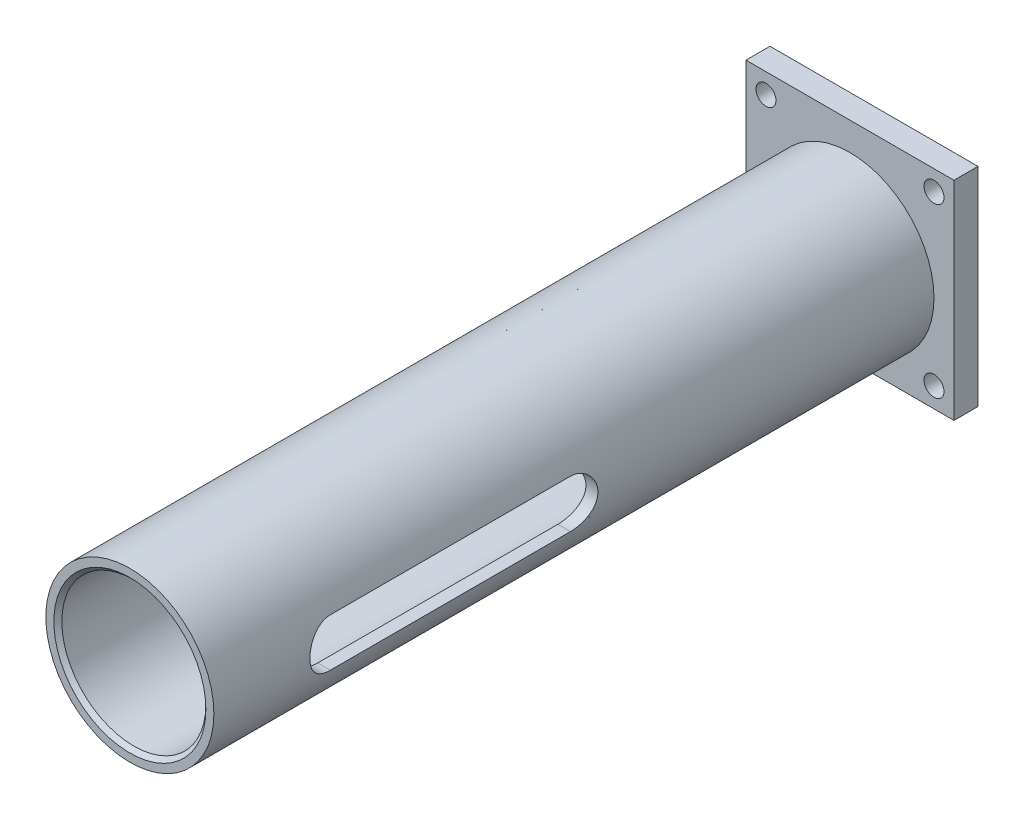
ISO-10303-21;
HEADER;
FILE_DESCRIPTION(('STEP AP214'),'2;1');
FILE_NAME('part.step','',(''),(''),'','','');
FILE_SCHEMA(('AUTOMOTIVE_DESIGN { 1 0 10303 214 1 1 1 1 }'));
ENDSEC;
DATA;
#1=APPLICATION_CONTEXT('core data for automotive mechanical design processes');
#2=APPLICATION_PROTOCOL_DEFINITION('international standard','automotive_design',2000,#1);
#3=PRODUCT_CONTEXT('',#1,'mechanical');
#4=PRODUCT('Part','Part','',(#3));
#5=PRODUCT_RELATED_PRODUCT_CATEGORY('part','',(#4));
#6=PRODUCT_DEFINITION_FORMATION('','',#4);
#7=PRODUCT_DEFINITION_CONTEXT('part definition',#1,'design');
#8=PRODUCT_DEFINITION('design','',#6,#7);
#9=PRODUCT_DEFINITION_SHAPE('','',#8);
#10=(LENGTH_UNIT() NAMED_UNIT(*) SI_UNIT(.MILLI.,.METRE.));
#11=(NAMED_UNIT(*) PLANE_ANGLE_UNIT() SI_UNIT($,.RADIAN.));
#12=(NAMED_UNIT(*) SI_UNIT($,.STERADIAN.) SOLID_ANGLE_UNIT());
#13=UNCERTAINTY_MEASURE_WITH_UNIT(LENGTH_MEASURE(1.E-05),#10,'distance_accuracy_value','');
#14=(GEOMETRIC_REPRESENTATION_CONTEXT(3) GLOBAL_UNCERTAINTY_ASSIGNED_CONTEXT((#13)) GLOBAL_UNIT_ASSIGNED_CONTEXT((#10,
#11,#12)) REPRESENTATION_CONTEXT('',''));
#15=CARTESIAN_POINT('',(0.,0.,0.));
#16=DIRECTION('',(0.,0.,1.));
#17=DIRECTION('',(1.,0.,0.));
#18=AXIS2_PLACEMENT_3D('',#15,#16,#17);
#19=CARTESIAN_POINT('',(0.,0.,3.));
#20=DIRECTION('',(0.,0.,1.));
#21=DIRECTION('',(1.,0.,0.));
#22=AXIS2_PLACEMENT_3D('',#19,#20,#21);
#23=PLANE('',#22);
#24=DIRECTION('',(0.,1.,0.));
#25=VECTOR('',#24,1.);
#26=CARTESIAN_POINT('',(13.,13.,3.));
#27=LINE('',#26,#25);
#28=CARTESIAN_POINT('',(13.,-13.,3.));
#29=VERTEX_POINT('',#28);
#30=CARTESIAN_POINT('',(13.,13.,3.));
#31=VERTEX_POINT('',#30);
#32=EDGE_CURVE('E297',#29,#31,#27,.T.);
#33=ORIENTED_EDGE('',*,*,#32,.T.);
#34=DIRECTION('',(-1.,0.,0.));
#35=VECTOR('',#34,1.);
#36=CARTESIAN_POINT('',(-13.,13.,3.));
#37=LINE('',#36,#35);
#38=CARTESIAN_POINT('',(-13.,13.,3.));
#39=VERTEX_POINT('',#38);
#40=EDGE_CURVE('E309',#31,#39,#37,.T.);
#41=ORIENTED_EDGE('',*,*,#40,.T.);
#42=DIRECTION('',(0.,-1.,0.));
#43=VECTOR('',#42,1.);
#44=CARTESIAN_POINT('',(-13.,13.,3.));
#45=LINE('',#44,#43);
#46=CARTESIAN_POINT('',(-13.,-13.,3.));
#47=VERTEX_POINT('',#46);
#48=EDGE_CURVE('E307',#39,#47,#45,.T.);
#49=ORIENTED_EDGE('',*,*,#48,.T.);
#50=DIRECTION('',(1.,0.,0.));
#51=VECTOR('',#50,1.);
#52=CARTESIAN_POINT('',(-13.,-13.,3.));
#53=LINE('',#52,#51);
#54=EDGE_CURVE('E294',#47,#29,#53,.T.);
#55=ORIENTED_EDGE('',*,*,#54,.T.);
#56=EDGE_LOOP('',(#33,#41,#49,#55));
#57=FACE_BOUND('',#56,.T.);
#58=CARTESIAN_POINT('',(0.,-0.999999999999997,3.));
#59=DIRECTION('',(0.,0.,1.));
#60=DIRECTION('',(1.,0.,0.));
#61=AXIS2_PLACEMENT_3D('',#58,#59,#60);
#62=CIRCLE('',#61,10.5);
#63=CARTESIAN_POINT('',(10.5,-0.999999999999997,3.));
#64=VERTEX_POINT('',#63);
#65=EDGE_CURVE('E316',#64,#64,#62,.T.);
#66=ORIENTED_EDGE('',*,*,#65,.F.);
#67=EDGE_LOOP('',(#66));
#68=FACE_BOUND('',#67,.T.);
#69=CARTESIAN_POINT('',(-10.5,-10.5,3.));
#70=DIRECTION('',(0.,0.,1.));
#71=DIRECTION('',(1.,0.,0.));
#72=AXIS2_PLACEMENT_3D('',#69,#70,#71);
#73=CIRCLE('',#72,1.25);
#74=CARTESIAN_POINT('',(-9.25,-10.5,3.));
#75=VERTEX_POINT('',#74);
#76=EDGE_CURVE('E333',#75,#75,#73,.T.);
#77=ORIENTED_EDGE('',*,*,#76,.F.);
#78=EDGE_LOOP('',(#77));
#79=FACE_BOUND('',#78,.T.);
#80=CARTESIAN_POINT('',(10.5,10.5,3.));
#81=DIRECTION('',(0.,0.,1.));
#82=DIRECTION('',(1.,0.,0.));
#83=AXIS2_PLACEMENT_3D('',#80,#81,#82);
#84=CIRCLE('',#83,1.25);
#85=CARTESIAN_POINT('',(11.75,10.5,3.));
#86=VERTEX_POINT('',#85);
#87=EDGE_CURVE('E337',#86,#86,#84,.T.);
#88=ORIENTED_EDGE('',*,*,#87,.F.);
#89=EDGE_LOOP('',(#88));
#90=FACE_BOUND('',#89,.T.);
#91=CARTESIAN_POINT('',(-10.5,10.5,3.));
#92=DIRECTION('',(0.,0.,1.));
#93=DIRECTION('',(1.,0.,0.));
#94=AXIS2_PLACEMENT_3D('',#91,#92,#93);
#95=CIRCLE('',#94,1.25);
#96=CARTESIAN_POINT('',(-9.25,10.5,3.));
#97=VERTEX_POINT('',#96);
#98=EDGE_CURVE('E341',#97,#97,#95,.T.);
#99=ORIENTED_EDGE('',*,*,#98,.F.);
#100=EDGE_LOOP('',(#99));
#101=FACE_BOUND('',#100,.T.);
#102=CARTESIAN_POINT('',(10.5,-10.5,3.));
#103=DIRECTION('',(0.,0.,1.));
#104=DIRECTION('',(1.,0.,0.));
#105=AXIS2_PLACEMENT_3D('',#102,#103,#104);
#106=CIRCLE('',#105,1.25);
#107=CARTESIAN_POINT('',(11.75,-10.5,3.));
#108=VERTEX_POINT('',#107);
#109=EDGE_CURVE('E344',#108,#108,#106,.T.);
#110=ORIENTED_EDGE('',*,*,#109,.F.);
#111=EDGE_LOOP('',(#110));
#112=FACE_BOUND('',#111,.T.);
#113=ADVANCED_FACE('F34',(#57,#68,#79,#90,#101,#112),#23,.T.);
#114=CARTESIAN_POINT('',(0.,0.,0.));
#115=DIRECTION('',(0.,0.,1.));
#116=DIRECTION('',(1.,0.,0.));
#117=AXIS2_PLACEMENT_3D('',#114,#115,#116);
#118=PLANE('',#117);
#119=DIRECTION('',(0.,1.,0.));
#120=VECTOR('',#119,1.);
#121=CARTESIAN_POINT('',(13.,13.,0.));
#122=LINE('',#121,#120);
#123=CARTESIAN_POINT('',(13.,-13.,0.));
#124=VERTEX_POINT('',#123);
#125=CARTESIAN_POINT('',(13.,13.,0.));
#126=VERTEX_POINT('',#125);
#127=EDGE_CURVE('E302',#124,#126,#122,.T.);
#128=ORIENTED_EDGE('',*,*,#127,.F.);
#129=DIRECTION('',(1.,0.,0.));
#130=VECTOR('',#129,1.);
#131=CARTESIAN_POINT('',(-13.,-13.,0.));
#132=LINE('',#131,#130);
#133=CARTESIAN_POINT('',(-13.,-13.,0.));
#134=VERTEX_POINT('',#133);
#135=EDGE_CURVE('E295',#134,#124,#132,.T.);
#136=ORIENTED_EDGE('',*,*,#135,.F.);
#137=DIRECTION('',(0.,-1.,0.));
#138=VECTOR('',#137,1.);
#139=CARTESIAN_POINT('',(-13.,13.,0.));
#140=LINE('',#139,#138);
#141=CARTESIAN_POINT('',(-13.,13.,0.));
#142=VERTEX_POINT('',#141);
#143=EDGE_CURVE('E298',#142,#134,#140,.T.);
#144=ORIENTED_EDGE('',*,*,#143,.F.);
#145=DIRECTION('',(-1.,0.,0.));
#146=VECTOR('',#145,1.);
#147=CARTESIAN_POINT('',(-13.,13.,0.));
#148=LINE('',#147,#146);
#149=EDGE_CURVE('E300',#126,#142,#148,.T.);
#150=ORIENTED_EDGE('',*,*,#149,.F.);
#151=EDGE_LOOP('',(#128,#136,#144,#150));
#152=FACE_BOUND('',#151,.T.);
#153=CARTESIAN_POINT('',(0.,-0.999999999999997,0.));
#154=DIRECTION('',(0.,0.,1.));
#155=DIRECTION('',(1.,0.,0.));
#156=AXIS2_PLACEMENT_3D('',#153,#154,#155);
#157=CIRCLE('',#156,11.15);
#158=CARTESIAN_POINT('',(11.15,-0.999999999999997,0.));
#159=VERTEX_POINT('',#158);
#160=EDGE_CURVE('E279',#159,#159,#157,.F.);
#161=ORIENTED_EDGE('',*,*,#160,.F.);
#162=EDGE_LOOP('',(#161));
#163=FACE_BOUND('',#162,.T.);
#164=CARTESIAN_POINT('',(-10.5,-10.5,0.));
#165=DIRECTION('',(0.,0.,1.));
#166=DIRECTION('',(1.,0.,0.));
#167=AXIS2_PLACEMENT_3D('',#164,#165,#166);
#168=CIRCLE('',#167,1.25);
#169=CARTESIAN_POINT('',(-9.25,-10.5,0.));
#170=VERTEX_POINT('',#169);
#171=EDGE_CURVE('E250',#170,#170,#168,.F.);
#172=ORIENTED_EDGE('',*,*,#171,.F.);
#173=EDGE_LOOP('',(#172));
#174=FACE_BOUND('',#173,.T.);
#175=CARTESIAN_POINT('',(10.5,10.5,0.));
#176=DIRECTION('',(0.,0.,1.));
#177=DIRECTION('',(1.,0.,0.));
#178=AXIS2_PLACEMENT_3D('',#175,#176,#177);
#179=CIRCLE('',#178,1.25);
#180=CARTESIAN_POINT('',(11.75,10.5,0.));
#181=VERTEX_POINT('',#180);
#182=EDGE_CURVE('E356',#181,#181,#179,.F.);
#183=ORIENTED_EDGE('',*,*,#182,.F.);
#184=EDGE_LOOP('',(#183));
#185=FACE_BOUND('',#184,.T.);
#186=CARTESIAN_POINT('',(-10.5,10.5,0.));
#187=DIRECTION('',(0.,0.,1.));
#188=DIRECTION('',(1.,0.,0.));
#189=AXIS2_PLACEMENT_3D('',#186,#187,#188);
#190=CIRCLE('',#189,1.25);
#191=CARTESIAN_POINT('',(-9.25,10.5,0.));
#192=VERTEX_POINT('',#191);
#193=EDGE_CURVE('E352',#192,#192,#190,.F.);
#194=ORIENTED_EDGE('',*,*,#193,.F.);
#195=EDGE_LOOP('',(#194));
#196=FACE_BOUND('',#195,.T.);
#197=CARTESIAN_POINT('',(10.5,-10.5,0.));
#198=DIRECTION('',(0.,0.,1.));
#199=DIRECTION('',(1.,0.,0.));
#200=AXIS2_PLACEMENT_3D('',#197,#198,#199);
#201=CIRCLE('',#200,1.25);
#202=CARTESIAN_POINT('',(11.75,-10.5,0.));
#203=VERTEX_POINT('',#202);
#204=EDGE_CURVE('E346',#203,#203,#201,.F.);
#205=ORIENTED_EDGE('',*,*,#204,.F.);
#206=EDGE_LOOP('',(#205));
#207=FACE_BOUND('',#206,.T.);
#208=ADVANCED_FACE('F328',(#152,#163,#174,#185,#196,#207),#118,.F.);
#209=CARTESIAN_POINT('',(13.,13.,3.));
#210=DIRECTION('',(-1.,0.,0.));
#211=DIRECTION('',(0.,-1.,0.));
#212=AXIS2_PLACEMENT_3D('',#209,#210,#211);
#213=PLANE('',#212);
#214=ORIENTED_EDGE('',*,*,#127,.T.);
#215=DIRECTION('',(0.,0.,-1.));
#216=VECTOR('',#215,1.);
#217=CARTESIAN_POINT('',(13.,13.,3.));
#218=LINE('',#217,#216);
#219=EDGE_CURVE('E282',#31,#126,#218,.T.);
#220=ORIENTED_EDGE('',*,*,#219,.F.);
#221=ORIENTED_EDGE('',*,*,#32,.F.);
#222=DIRECTION('',(0.,0.,-1.));
#223=VECTOR('',#222,1.);
#224=CARTESIAN_POINT('',(13.,-13.,3.));
#225=LINE('',#224,#223);
#226=EDGE_CURVE('E291',#29,#124,#225,.T.);
#227=ORIENTED_EDGE('',*,*,#226,.T.);
#228=EDGE_LOOP('',(#214,#220,#221,#227));
#229=FACE_BOUND('',#228,.T.);
#230=ADVANCED_FACE('F367',(#229),#213,.F.);
#231=CARTESIAN_POINT('',(-13.,13.,3.));
#232=DIRECTION('',(0.,-1.,0.));
#233=DIRECTION('',(0.,0.,-1.));
#234=AXIS2_PLACEMENT_3D('',#231,#232,#233);
#235=PLANE('',#234);
#236=ORIENTED_EDGE('',*,*,#149,.T.);
#237=DIRECTION('',(0.,0.,-1.));
#238=VECTOR('',#237,1.);
#239=CARTESIAN_POINT('',(-13.,13.,3.));
#240=LINE('',#239,#238);
#241=EDGE_CURVE('E285',#39,#142,#240,.T.);
#242=ORIENTED_EDGE('',*,*,#241,.F.);
#243=ORIENTED_EDGE('',*,*,#40,.F.);
#244=ORIENTED_EDGE('',*,*,#219,.T.);
#245=EDGE_LOOP('',(#236,#242,#243,#244));
#246=FACE_BOUND('',#245,.T.);
#247=ADVANCED_FACE('F425',(#246),#235,.F.);
#248=CARTESIAN_POINT('',(-13.,13.,3.));
#249=DIRECTION('',(1.,0.,0.));
#250=DIRECTION('',(0.,1.,0.));
#251=AXIS2_PLACEMENT_3D('',#248,#249,#250);
#252=PLANE('',#251);
#253=ORIENTED_EDGE('',*,*,#143,.T.);
#254=DIRECTION('',(0.,0.,-1.));
#255=VECTOR('',#254,1.);
#256=CARTESIAN_POINT('',(-13.,-13.,3.));
#257=LINE('',#256,#255);
#258=EDGE_CURVE('E288',#47,#134,#257,.T.);
#259=ORIENTED_EDGE('',*,*,#258,.F.);
#260=ORIENTED_EDGE('',*,*,#48,.F.);
#261=ORIENTED_EDGE('',*,*,#241,.T.);
#262=EDGE_LOOP('',(#253,#259,#260,#261));
#263=FACE_BOUND('',#262,.T.);
#264=ADVANCED_FACE('F429',(#263),#252,.F.);
#265=CARTESIAN_POINT('',(-13.,-13.,3.));
#266=DIRECTION('',(0.,1.,0.));
#267=DIRECTION('',(0.,0.,1.));
#268=AXIS2_PLACEMENT_3D('',#265,#266,#267);
#269=PLANE('',#268);
#270=ORIENTED_EDGE('',*,*,#135,.T.);
#271=ORIENTED_EDGE('',*,*,#226,.F.);
#272=ORIENTED_EDGE('',*,*,#54,.F.);
#273=ORIENTED_EDGE('',*,*,#258,.T.);
#274=EDGE_LOOP('',(#270,#271,#272,#273));
#275=FACE_BOUND('',#274,.T.);
#276=ADVANCED_FACE('F194',(#275),#269,.F.);
#277=CARTESIAN_POINT('',(0.,-0.999999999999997,3.));
#278=DIRECTION('',(0.,0.,-1.));
#279=DIRECTION('',(-1.,0.,0.));
#280=AXIS2_PLACEMENT_3D('',#277,#278,#279);
#281=CYLINDRICAL_SURFACE('',#280,9.);
#282=CARTESIAN_POINT('',(0.,-0.999999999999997,92.5));
#283=DIRECTION('',(0.,0.,1.));
#284=DIRECTION('',(1.,0.,0.));
#285=AXIS2_PLACEMENT_3D('',#282,#283,#284);
#286=CIRCLE('',#285,9.);
#287=CARTESIAN_POINT('',(9.00000000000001,-0.999999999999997,92.5));
#288=VERTEX_POINT('',#287);
#289=EDGE_CURVE('E42',#288,#288,#286,.T.);
#290=ORIENTED_EDGE('',*,*,#289,.T.);
#291=EDGE_LOOP('',(#290));
#292=FACE_BOUND('',#291,.T.);
#293=CARTESIAN_POINT('',(-8.48528137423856,2.,78.));
#294=CARTESIAN_POINT('',(-8.48526831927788,2.00001078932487,78.0818484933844));
#295=CARTESIAN_POINT('',(-8.48646532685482,1.99665064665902,78.1636896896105));
#296=CARTESIAN_POINT('',(-8.49118228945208,1.98327254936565,78.3267372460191));
#297=CARTESIAN_POINT('',(-8.4947016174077,1.97325639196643,78.4079437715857));
#298=CARTESIAN_POINT('',(-8.50395246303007,1.94668951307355,78.5689085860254));
#299=CARTESIAN_POINT('',(-8.50967741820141,1.93015817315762,78.648670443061));
#300=CARTESIAN_POINT('',(-8.52315143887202,1.89073017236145,78.8064099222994));
#301=CARTESIAN_POINT('',(-8.53090057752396,1.86783328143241,78.884387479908));
#302=CARTESIAN_POINT('',(-8.55683928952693,1.78989861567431,79.1147538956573));
#303=CARTESIAN_POINT('',(-8.57773492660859,1.72557700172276,79.2638149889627));
#304=CARTESIAN_POINT('',(-8.62436440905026,1.5742134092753,79.5490521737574));
#305=CARTESIAN_POINT('',(-8.65010122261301,1.4871574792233,79.6852202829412));
#306=CARTESIAN_POINT('',(-8.70463418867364,1.28915595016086,79.9461514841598));
#307=CARTESIAN_POINT('',(-8.73350627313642,1.17747541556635,80.0703421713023));
#308=CARTESIAN_POINT('',(-8.79041552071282,0.934964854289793,80.2986205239));
#309=CARTESIAN_POINT('',(-8.81845253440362,0.804131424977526,80.402704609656));
#310=CARTESIAN_POINT('',(-8.87141647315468,0.52281106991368,80.5904378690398));
#311=CARTESIAN_POINT('',(-8.8962431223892,0.371900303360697,80.6734827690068));
#312=CARTESIAN_POINT('',(-8.93908826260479,0.0572877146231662,80.8127769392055));
#313=CARTESIAN_POINT('',(-8.95710883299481,-0.106410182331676,80.8690343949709));
#314=CARTESIAN_POINT('',(-8.98377213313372,-0.43591195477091,80.9512071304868));
#315=CARTESIAN_POINT('',(-8.9927192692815,-0.601444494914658,80.9781098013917));
#316=CARTESIAN_POINT('',(-9.00130825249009,-0.934903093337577,81.0039489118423));
#317=CARTESIAN_POINT('',(-9.00095231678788,-1.10282857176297,81.0028920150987));
#318=CARTESIAN_POINT('',(-8.99118115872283,-1.42931153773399,80.9734671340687));
#319=CARTESIAN_POINT('',(-8.98212182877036,-1.58797811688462,80.9461720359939));
#320=CARTESIAN_POINT('',(-8.95640881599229,-1.89833218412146,80.8668204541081));
#321=CARTESIAN_POINT('',(-8.93975471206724,-2.05001928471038,80.8147625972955));
#322=CARTESIAN_POINT('',(-8.9002700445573,-2.34445790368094,80.6867357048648));
#323=CARTESIAN_POINT('',(-8.87736112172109,-2.48706564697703,80.6104611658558));
#324=CARTESIAN_POINT('',(-8.82775164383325,-2.757773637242,80.4364208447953));
#325=CARTESIAN_POINT('',(-8.80105005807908,-2.88586992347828,80.3386492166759));
#326=CARTESIAN_POINT('',(-8.74518810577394,-3.13029252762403,80.1189841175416));
#327=CARTESIAN_POINT('',(-8.71597116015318,-3.24578277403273,79.9961729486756));
#328=CARTESIAN_POINT('',(-8.65942491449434,-3.45481413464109,79.7326859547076));
#329=CARTESIAN_POINT('',(-8.63209622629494,-3.5483481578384,79.5920043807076));
#330=CARTESIAN_POINT('',(-8.58210018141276,-3.71201733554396,79.2939199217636));
#331=CARTESIAN_POINT('',(-8.55950759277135,-3.78178668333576,79.1363008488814));
#332=CARTESIAN_POINT('',(-8.53168491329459,-3.86551808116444,78.8923158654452));
#333=CARTESIAN_POINT('',(-8.52342263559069,-3.889939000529,78.8097432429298));
#334=CARTESIAN_POINT('',(-8.50917513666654,-3.93162549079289,78.6426296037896));
#335=CARTESIAN_POINT('',(-8.50318887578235,-3.94889432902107,78.5580895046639));
#336=CARTESIAN_POINT('',(-8.49410161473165,-3.97496555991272,78.3947667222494));
#337=CARTESIAN_POINT('',(-8.49080270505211,-3.98435073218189,78.3160871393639));
#338=CARTESIAN_POINT('',(-8.48638843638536,-3.99686829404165,78.1582744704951));
#339=CARTESIAN_POINT('',(-8.48527025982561,-4.00000875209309,78.0791421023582));
#340=CARTESIAN_POINT('',(-8.48528137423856,-4.,78.));
#341=B_SPLINE_CURVE_WITH_KNOTS('',3,(#293,#294,#295,#296,#297,#298,#299,#300,#301,#302,#303,
#304,#305,#306,#307,#308,#309,#310,#311,#312,#313,#314,#315,#316,#317,#318,#319,#320,#321,#322,
#323,#324,#325,#326,#327,#328,#329,#330,#331,#332,#333,#334,#335,#336,#337,#338,#339,#340),
.UNSPECIFIED.,.F.,.F.,(4,2,2,2,2,2,2,2,2,2,2,2,2,2,2,2,2,2,2,2,2,2,2,4),(0.,0.245455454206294,
0.490844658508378,0.735509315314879,0.980182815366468,1.46881220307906,1.95774215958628,
2.46393436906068,2.97021661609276,3.48971320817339,4.00905095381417,4.51032334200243,
5.01147626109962,5.4929717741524,5.97449398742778,6.46234978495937,6.9503384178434,
7.46126084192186,7.97234804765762,8.49098011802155,8.75020549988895,9.0093123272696,
9.24695816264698,9.48429674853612),.UNSPECIFIED.);
#342=CARTESIAN_POINT('',(-8.48528137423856,2.,78.));
#343=VERTEX_POINT('',#342);
#344=CARTESIAN_POINT('',(-8.48528137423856,-4.,78.));
#345=VERTEX_POINT('',#344);
#346=EDGE_CURVE('E138',#343,#345,#341,.T.);
#347=ORIENTED_EDGE('',*,*,#346,.F.);
#348=DIRECTION('',(0.,0.,-1.));
#349=VECTOR('',#348,1.);
#350=CARTESIAN_POINT('',(-8.48528137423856,2.,3.));
#351=LINE('',#350,#349);
#352=CARTESIAN_POINT('',(-8.48528137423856,2.,48.));
#353=VERTEX_POINT('',#352);
#354=EDGE_CURVE('E212',#353,#343,#351,.F.);
#355=ORIENTED_EDGE('',*,*,#354,.F.);
#356=CARTESIAN_POINT('',(-8.48528137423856,-4.,48.));
#357=CARTESIAN_POINT('',(-8.48526831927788,-4.00001078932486,47.9181515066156));
#358=CARTESIAN_POINT('',(-8.48646532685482,-3.99665064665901,47.8363103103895));
#359=CARTESIAN_POINT('',(-8.49118228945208,-3.98327254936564,47.6732627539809));
#360=CARTESIAN_POINT('',(-8.4947016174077,-3.97325639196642,47.5920562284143));
#361=CARTESIAN_POINT('',(-8.50395246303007,-3.94668951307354,47.4310914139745));
#362=CARTESIAN_POINT('',(-8.50967741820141,-3.93015817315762,47.351329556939));
#363=CARTESIAN_POINT('',(-8.52315143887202,-3.89073017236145,47.1935900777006));
#364=CARTESIAN_POINT('',(-8.53090057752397,-3.8678332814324,47.115612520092));
#365=CARTESIAN_POINT('',(-8.55683928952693,-3.7898986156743,46.8852461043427));
#366=CARTESIAN_POINT('',(-8.57773492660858,-3.72557700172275,46.7361850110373));
#367=CARTESIAN_POINT('',(-8.62436440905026,-3.57421340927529,46.4509478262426));
#368=CARTESIAN_POINT('',(-8.65010122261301,-3.4871574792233,46.3147797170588));
#369=CARTESIAN_POINT('',(-8.70463418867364,-3.28915595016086,46.0538485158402));
#370=CARTESIAN_POINT('',(-8.73350627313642,-3.17747541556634,45.9296578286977));
#371=CARTESIAN_POINT('',(-8.79041552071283,-2.93496485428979,45.7013794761));
#372=CARTESIAN_POINT('',(-8.81845253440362,-2.80413142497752,45.597295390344));
#373=CARTESIAN_POINT('',(-8.87141647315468,-2.52281106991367,45.4095621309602));
#374=CARTESIAN_POINT('',(-8.8962431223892,-2.37190030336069,45.3265172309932));
#375=CARTESIAN_POINT('',(-8.93908826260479,-2.05728771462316,45.1872230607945));
#376=CARTESIAN_POINT('',(-8.95710883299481,-1.89358981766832,45.1309656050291));
#377=CARTESIAN_POINT('',(-8.98377213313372,-1.56408804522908,45.0487928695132));
#378=CARTESIAN_POINT('',(-8.9927192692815,-1.39855550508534,45.0218901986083));
#379=CARTESIAN_POINT('',(-9.00130825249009,-1.06509690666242,44.9960510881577));
#380=CARTESIAN_POINT('',(-9.00095231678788,-0.897171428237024,44.9971079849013));
#381=CARTESIAN_POINT('',(-8.99118115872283,-0.57068846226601,45.0265328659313));
#382=CARTESIAN_POINT('',(-8.98212182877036,-0.412021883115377,45.0538279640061));
#383=CARTESIAN_POINT('',(-8.95640881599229,-0.101667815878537,45.1331795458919));
#384=CARTESIAN_POINT('',(-8.93975471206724,0.0500192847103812,45.1852374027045));
#385=CARTESIAN_POINT('',(-8.9002700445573,0.344457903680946,45.3132642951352));
#386=CARTESIAN_POINT('',(-8.87736112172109,0.487065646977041,45.3895388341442));
#387=CARTESIAN_POINT('',(-8.82775164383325,0.757773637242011,45.5635791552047));
#388=CARTESIAN_POINT('',(-8.80105005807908,0.88586992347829,45.6613507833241));
#389=CARTESIAN_POINT('',(-8.74518810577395,1.13029252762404,45.8810158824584));
#390=CARTESIAN_POINT('',(-8.71597116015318,1.24578277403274,46.0038270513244));
#391=CARTESIAN_POINT('',(-8.65942491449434,1.4548141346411,46.2673140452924));
#392=CARTESIAN_POINT('',(-8.63209622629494,1.5483481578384,46.4079956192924));
#393=CARTESIAN_POINT('',(-8.58210018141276,1.71201733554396,46.7060800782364));
#394=CARTESIAN_POINT('',(-8.55950759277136,1.78178668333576,46.8636991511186));
#395=CARTESIAN_POINT('',(-8.53168491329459,1.86551808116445,47.1076841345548));
#396=CARTESIAN_POINT('',(-8.52342263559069,1.88993900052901,47.1902567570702));
#397=CARTESIAN_POINT('',(-8.50917513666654,1.9316254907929,47.3573703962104));
#398=CARTESIAN_POINT('',(-8.50318887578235,1.94889432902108,47.4419104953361));
#399=CARTESIAN_POINT('',(-8.49410161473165,1.97496555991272,47.6052332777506));
#400=CARTESIAN_POINT('',(-8.49080270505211,1.98435073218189,47.6839128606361));
#401=CARTESIAN_POINT('',(-8.48638843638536,1.99686829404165,47.8417255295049));
#402=CARTESIAN_POINT('',(-8.48527025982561,2.0000087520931,47.9208578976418));
#403=CARTESIAN_POINT('',(-8.48528137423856,2.,48.));
#404=B_SPLINE_CURVE_WITH_KNOTS('',3,(#356,#357,#358,#359,#360,#361,#362,#363,#364,#365,#366,
#367,#368,#369,#370,#371,#372,#373,#374,#375,#376,#377,#378,#379,#380,#381,#382,#383,#384,#385,
#386,#387,#388,#389,#390,#391,#392,#393,#394,#395,#396,#397,#398,#399,#400,#401,#402,#403),
.UNSPECIFIED.,.F.,.F.,(4,2,2,2,2,2,2,2,2,2,2,2,2,2,2,2,2,2,2,2,2,2,2,4),(0.,0.245455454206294,
0.490844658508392,0.735509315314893,0.980182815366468,1.46881220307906,1.95774215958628,
2.46393436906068,2.97021661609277,3.48971320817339,4.00905095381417,4.51032334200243,
5.01147626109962,5.4929717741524,5.97449398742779,6.46234978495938,6.95033841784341,
7.46126084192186,7.97234804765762,8.49098011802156,8.75020549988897,9.00931232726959,
9.24695816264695,9.4842967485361),.UNSPECIFIED.);
#405=CARTESIAN_POINT('',(-8.48528137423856,-4.,48.));
#406=VERTEX_POINT('',#405);
#407=EDGE_CURVE('E201',#406,#353,#404,.T.);
#408=ORIENTED_EDGE('',*,*,#407,.F.);
#409=DIRECTION('',(0.,0.,-1.));
#410=VECTOR('',#409,1.);
#411=CARTESIAN_POINT('',(-8.48528137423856,-4.,3.));
#412=LINE('',#411,#410);
#413=EDGE_CURVE('E252',#345,#406,#412,.T.);
#414=ORIENTED_EDGE('',*,*,#413,.F.);
#415=EDGE_LOOP('',(#347,#355,#408,#414));
#416=FACE_BOUND('',#415,.T.);
#417=CARTESIAN_POINT('',(8.48528137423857,-4.,78.));
#418=CARTESIAN_POINT('',(8.48526831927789,-4.00001078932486,78.0818484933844));
#419=CARTESIAN_POINT('',(8.48646532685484,-3.99665064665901,78.1636896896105));
#420=CARTESIAN_POINT('',(8.49118228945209,-3.98327254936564,78.3267372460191));
#421=CARTESIAN_POINT('',(8.49470161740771,-3.97325639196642,78.4079437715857));
#422=CARTESIAN_POINT('',(8.50395246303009,-3.94668951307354,78.5689085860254));
#423=CARTESIAN_POINT('',(8.50967741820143,-3.93015817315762,78.648670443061));
#424=CARTESIAN_POINT('',(8.52315143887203,-3.89073017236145,78.8064099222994));
#425=CARTESIAN_POINT('',(8.53090057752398,-3.8678332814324,78.884387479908));
#426=CARTESIAN_POINT('',(8.55683928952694,-3.7898986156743,79.1147538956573));
#427=CARTESIAN_POINT('',(8.5777349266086,-3.72557700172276,79.2638149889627));
#428=CARTESIAN_POINT('',(8.62436440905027,-3.5742134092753,79.5490521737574));
#429=CARTESIAN_POINT('',(8.65010122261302,-3.4871574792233,79.6852202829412));
#430=CARTESIAN_POINT('',(8.70463418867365,-3.28915595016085,79.9461514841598));
#431=CARTESIAN_POINT('',(8.73350627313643,-3.17747541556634,80.0703421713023));
#432=CARTESIAN_POINT('',(8.79041552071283,-2.93496485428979,80.2986205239));
#433=CARTESIAN_POINT('',(8.81845253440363,-2.80413142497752,80.402704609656));
#434=CARTESIAN_POINT('',(8.87141647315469,-2.52281106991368,80.5904378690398));
#435=CARTESIAN_POINT('',(8.89624312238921,-2.37190030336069,80.6734827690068));
#436=CARTESIAN_POINT('',(8.9390882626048,-2.05728771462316,80.8127769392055));
#437=CARTESIAN_POINT('',(8.95710883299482,-1.89358981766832,80.8690343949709));
#438=CARTESIAN_POINT('',(8.98377213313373,-1.56408804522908,80.9512071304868));
#439=CARTESIAN_POINT('',(8.99271926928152,-1.39855550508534,80.9781098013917));
#440=CARTESIAN_POINT('',(9.00130825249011,-1.06509690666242,81.0039489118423));
#441=CARTESIAN_POINT('',(9.00095231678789,-0.897171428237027,81.0028920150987));
#442=CARTESIAN_POINT('',(8.99118115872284,-0.570688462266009,80.9734671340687));
#443=CARTESIAN_POINT('',(8.98212182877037,-0.412021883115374,80.9461720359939));
#444=CARTESIAN_POINT('',(8.9564088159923,-0.101667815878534,80.8668204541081));
#445=CARTESIAN_POINT('',(8.93975471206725,0.0500192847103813,80.8147625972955));
#446=CARTESIAN_POINT('',(8.90027004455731,0.344457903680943,80.6867357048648));
#447=CARTESIAN_POINT('',(8.8773611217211,0.487065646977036,80.6104611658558));
#448=CARTESIAN_POINT('',(8.82775164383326,0.757773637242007,80.4364208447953));
#449=CARTESIAN_POINT('',(8.8010500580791,0.885869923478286,80.3386492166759));
#450=CARTESIAN_POINT('',(8.74518810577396,1.13029252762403,80.1189841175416));
#451=CARTESIAN_POINT('',(8.71597116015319,1.24578277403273,79.9961729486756));
#452=CARTESIAN_POINT('',(8.65942491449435,1.4548141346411,79.7326859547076));
#453=CARTESIAN_POINT('',(8.63209622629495,1.5483481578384,79.5920043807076));
#454=CARTESIAN_POINT('',(8.58210018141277,1.71201733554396,79.2939199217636));
#455=CARTESIAN_POINT('',(8.55950759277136,1.78178668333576,79.1363008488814));
#456=CARTESIAN_POINT('',(8.5316849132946,1.86551808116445,78.8923158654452));
#457=CARTESIAN_POINT('',(8.5234226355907,1.889939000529,78.8097432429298));
#458=CARTESIAN_POINT('',(8.50917513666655,1.9316254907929,78.6426296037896));
#459=CARTESIAN_POINT('',(8.50318887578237,1.94889432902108,78.5580895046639));
#460=CARTESIAN_POINT('',(8.49410161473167,1.97496555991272,78.3947667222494));
#461=CARTESIAN_POINT('',(8.49080270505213,1.98435073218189,78.3160871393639));
#462=CARTESIAN_POINT('',(8.48638843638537,1.99686829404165,78.1582744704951));
#463=CARTESIAN_POINT('',(8.48527025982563,2.0000087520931,78.0791421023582));
#464=CARTESIAN_POINT('',(8.48528137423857,2.,78.));
#465=B_SPLINE_CURVE_WITH_KNOTS('',3,(#417,#418,#419,#420,#421,#422,#423,#424,#425,#426,#427,
#428,#429,#430,#431,#432,#433,#434,#435,#436,#437,#438,#439,#440,#441,#442,#443,#444,#445,#446,
#447,#448,#449,#450,#451,#452,#453,#454,#455,#456,#457,#458,#459,#460,#461,#462,#463,#464),
.UNSPECIFIED.,.F.,.F.,(4,2,2,2,2,2,2,2,2,2,2,2,2,2,2,2,2,2,2,2,2,2,2,4),(0.,0.245455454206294,
0.490844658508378,0.735509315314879,0.980182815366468,1.46881220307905,1.95774215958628,
2.46393436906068,2.97021661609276,3.48971320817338,4.00905095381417,4.51032334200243,
5.01147626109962,5.4929717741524,5.97449398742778,6.46234978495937,6.9503384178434,
7.46126084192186,7.97234804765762,8.49098011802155,8.75020549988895,9.0093123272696,
9.24695816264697,9.48429674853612),.UNSPECIFIED.);
#466=CARTESIAN_POINT('',(8.48528137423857,-4.,78.));
#467=VERTEX_POINT('',#466);
#468=CARTESIAN_POINT('',(8.48528137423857,2.,78.));
#469=VERTEX_POINT('',#468);
#470=EDGE_CURVE('E181',#467,#469,#465,.T.);
#471=ORIENTED_EDGE('',*,*,#470,.F.);
#472=DIRECTION('',(0.,0.,-1.));
#473=VECTOR('',#472,1.);
#474=CARTESIAN_POINT('',(8.48528137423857,-4.,3.));
#475=LINE('',#474,#473);
#476=CARTESIAN_POINT('',(8.48528137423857,-4.,48.));
#477=VERTEX_POINT('',#476);
#478=EDGE_CURVE('E251',#477,#467,#475,.F.);
#479=ORIENTED_EDGE('',*,*,#478,.F.);
#480=CARTESIAN_POINT('',(8.48528137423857,2.,48.));
#481=CARTESIAN_POINT('',(8.48526831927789,2.00001078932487,47.9181515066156));
#482=CARTESIAN_POINT('',(8.48646532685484,1.99665064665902,47.8363103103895));
#483=CARTESIAN_POINT('',(8.49118228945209,1.98327254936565,47.6732627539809));
#484=CARTESIAN_POINT('',(8.49470161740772,1.97325639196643,47.5920562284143));
#485=CARTESIAN_POINT('',(8.50395246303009,1.94668951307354,47.4310914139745));
#486=CARTESIAN_POINT('',(8.50967741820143,1.93015817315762,47.351329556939));
#487=CARTESIAN_POINT('',(8.52315143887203,1.89073017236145,47.1935900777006));
#488=CARTESIAN_POINT('',(8.53090057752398,1.86783328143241,47.115612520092));
#489=CARTESIAN_POINT('',(8.55683928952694,1.78989861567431,46.8852461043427));
#490=CARTESIAN_POINT('',(8.5777349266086,1.72557700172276,46.7361850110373));
#491=CARTESIAN_POINT('',(8.62436440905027,1.5742134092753,46.4509478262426));
#492=CARTESIAN_POINT('',(8.65010122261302,1.48715747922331,46.3147797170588));
#493=CARTESIAN_POINT('',(8.70463418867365,1.28915595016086,46.0538485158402));
#494=CARTESIAN_POINT('',(8.73350627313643,1.17747541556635,45.9296578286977));
#495=CARTESIAN_POINT('',(8.79041552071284,0.934964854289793,45.7013794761));
#496=CARTESIAN_POINT('',(8.81845253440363,0.804131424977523,45.597295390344));
#497=CARTESIAN_POINT('',(8.87141647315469,0.522811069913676,45.4095621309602));
#498=CARTESIAN_POINT('',(8.89624312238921,0.371900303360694,45.3265172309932));
#499=CARTESIAN_POINT('',(8.9390882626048,0.0572877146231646,45.1872230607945));
#500=CARTESIAN_POINT('',(8.95710883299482,-0.106410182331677,45.1309656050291));
#501=CARTESIAN_POINT('',(8.98377213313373,-0.435911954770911,45.0487928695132));
#502=CARTESIAN_POINT('',(8.99271926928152,-0.601444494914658,45.0218901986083));
#503=CARTESIAN_POINT('',(9.00130825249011,-0.934903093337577,44.9960510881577));
#504=CARTESIAN_POINT('',(9.00095231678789,-1.10282857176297,44.9971079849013));
#505=CARTESIAN_POINT('',(8.99118115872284,-1.42931153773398,45.0265328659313));
#506=CARTESIAN_POINT('',(8.98212182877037,-1.58797811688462,45.0538279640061));
#507=CARTESIAN_POINT('',(8.9564088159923,-1.89833218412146,45.1331795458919));
#508=CARTESIAN_POINT('',(8.93975471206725,-2.05001928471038,45.1852374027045));
#509=CARTESIAN_POINT('',(8.90027004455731,-2.34445790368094,45.3132642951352));
#510=CARTESIAN_POINT('',(8.8773611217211,-2.48706564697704,45.3895388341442));
#511=CARTESIAN_POINT('',(8.82775164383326,-2.75777363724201,45.5635791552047));
#512=CARTESIAN_POINT('',(8.80105005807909,-2.88586992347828,45.6613507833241));
#513=CARTESIAN_POINT('',(8.74518810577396,-3.13029252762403,45.8810158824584));
#514=CARTESIAN_POINT('',(8.7159711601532,-3.24578277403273,46.0038270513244));
#515=CARTESIAN_POINT('',(8.65942491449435,-3.45481413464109,46.2673140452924));
#516=CARTESIAN_POINT('',(8.63209622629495,-3.54834815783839,46.4079956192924));
#517=CARTESIAN_POINT('',(8.58210018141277,-3.71201733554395,46.7060800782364));
#518=CARTESIAN_POINT('',(8.55950759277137,-3.78178668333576,46.8636991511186));
#519=CARTESIAN_POINT('',(8.5316849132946,-3.86551808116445,47.1076841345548));
#520=CARTESIAN_POINT('',(8.5234226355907,-3.889939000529,47.1902567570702));
#521=CARTESIAN_POINT('',(8.50917513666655,-3.93162549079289,47.3573703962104));
#522=CARTESIAN_POINT('',(8.50318887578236,-3.94889432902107,47.4419104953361));
#523=CARTESIAN_POINT('',(8.49410161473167,-3.97496555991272,47.6052332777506));
#524=CARTESIAN_POINT('',(8.49080270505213,-3.98435073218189,47.6839128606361));
#525=CARTESIAN_POINT('',(8.48638843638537,-3.99686829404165,47.8417255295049));
#526=CARTESIAN_POINT('',(8.48527025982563,-4.00000875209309,47.9208578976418));
#527=CARTESIAN_POINT('',(8.48528137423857,-4.,48.));
#528=B_SPLINE_CURVE_WITH_KNOTS('',3,(#480,#481,#482,#483,#484,#485,#486,#487,#488,#489,#490,
#491,#492,#493,#494,#495,#496,#497,#498,#499,#500,#501,#502,#503,#504,#505,#506,#507,#508,#509,
#510,#511,#512,#513,#514,#515,#516,#517,#518,#519,#520,#521,#522,#523,#524,#525,#526,#527),
.UNSPECIFIED.,.F.,.F.,(4,2,2,2,2,2,2,2,2,2,2,2,2,2,2,2,2,2,2,2,2,2,2,4),(0.,0.245455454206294,
0.490844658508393,0.735509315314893,0.980182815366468,1.46881220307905,1.95774215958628,
2.46393436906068,2.97021661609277,3.48971320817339,4.00905095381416,4.51032334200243,
5.01147626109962,5.4929717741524,5.97449398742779,6.46234978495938,6.9503384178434,
7.46126084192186,7.97234804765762,8.49098011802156,8.75020549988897,9.00931232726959,
9.24695816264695,9.4842967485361),.UNSPECIFIED.);
#529=CARTESIAN_POINT('',(8.48528137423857,2.,48.));
#530=VERTEX_POINT('',#529);
#531=EDGE_CURVE('E208',#530,#477,#528,.T.);
#532=ORIENTED_EDGE('',*,*,#531,.F.);
#533=DIRECTION('',(0.,0.,-1.));
#534=VECTOR('',#533,1.);
#535=CARTESIAN_POINT('',(8.48528137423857,2.,3.));
#536=LINE('',#535,#534);
#537=EDGE_CURVE('E182',#469,#530,#536,.T.);
#538=ORIENTED_EDGE('',*,*,#537,.F.);
#539=EDGE_LOOP('',(#471,#479,#532,#538));
#540=FACE_BOUND('',#539,.T.);
#541=CARTESIAN_POINT('',(0.,-0.999999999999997,-2.));
#542=DIRECTION('',(0.,0.,-1.));
#543=DIRECTION('',(-1.,0.,0.));
#544=AXIS2_PLACEMENT_3D('',#541,#542,#543);
#545=CIRCLE('',#544,9.);
#546=CARTESIAN_POINT('',(-8.99999999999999,-0.999999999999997,-2.));
#547=VERTEX_POINT('',#546);
#548=EDGE_CURVE('E305',#547,#547,#545,.T.);
#549=ORIENTED_EDGE('',*,*,#548,.T.);
#550=EDGE_LOOP('',(#549));
#551=FACE_BOUND('',#550,.T.);
#552=ADVANCED_FACE('F188',(#292,#416,#540,#551),#281,.F.);
#553=CARTESIAN_POINT('',(0.,-0.999999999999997,-2.));
#554=DIRECTION('',(0.,0.,-1.));
#555=DIRECTION('',(-1.,0.,0.));
#556=AXIS2_PLACEMENT_3D('',#553,#554,#555);
#557=PLANE('',#556);
#558=CARTESIAN_POINT('',(0.,-0.999999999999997,-2.));
#559=DIRECTION('',(0.,0.,-1.));
#560=DIRECTION('',(-1.,0.,0.));
#561=AXIS2_PLACEMENT_3D('',#558,#559,#560);
#562=CIRCLE('',#561,10.65);
#563=CARTESIAN_POINT('',(-10.65,-0.999999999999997,-2.));
#564=VERTEX_POINT('',#563);
#565=EDGE_CURVE('E274',#564,#564,#562,.T.);
#566=ORIENTED_EDGE('',*,*,#565,.T.);
#567=EDGE_LOOP('',(#566));
#568=FACE_BOUND('',#567,.T.);
#569=ORIENTED_EDGE('',*,*,#548,.F.);
#570=EDGE_LOOP('',(#569));
#571=FACE_BOUND('',#570,.T.);
#572=ADVANCED_FACE('F193',(#568,#571),#557,.T.);
#573=CARTESIAN_POINT('',(0.,-0.999999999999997,-2.));
#574=DIRECTION('',(0.,0.,1.));
#575=DIRECTION('',(1.,0.,0.));
#576=AXIS2_PLACEMENT_3D('',#573,#574,#575);
#577=CYLINDRICAL_SURFACE('',#576,11.15);
#578=CARTESIAN_POINT('',(0.,-0.999999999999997,-1.5));
#579=DIRECTION('',(0.,0.,-1.));
#580=DIRECTION('',(-1.,0.,0.));
#581=AXIS2_PLACEMENT_3D('',#578,#579,#580);
#582=CIRCLE('',#581,11.15);
#583=CARTESIAN_POINT('',(-11.15,-0.999999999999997,-1.5));
#584=VERTEX_POINT('',#583);
#585=EDGE_CURVE('E272',#584,#584,#582,.F.);
#586=ORIENTED_EDGE('',*,*,#585,.T.);
#587=EDGE_LOOP('',(#586));
#588=FACE_BOUND('',#587,.T.);
#589=ORIENTED_EDGE('',*,*,#160,.T.);
#590=EDGE_LOOP('',(#589));
#591=FACE_BOUND('',#590,.T.);
#592=ADVANCED_FACE('F196',(#588,#591),#577,.T.);
#593=CARTESIAN_POINT('',(0.,-0.999999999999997,93.));
#594=DIRECTION('',(0.,0.,1.));
#595=DIRECTION('',(1.,0.,0.));
#596=AXIS2_PLACEMENT_3D('',#593,#594,#595);
#597=PLANE('',#596);
#598=CARTESIAN_POINT('',(0.,-0.999999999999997,93.));
#599=DIRECTION('',(0.,0.,1.));
#600=DIRECTION('',(1.,0.,0.));
#601=AXIS2_PLACEMENT_3D('',#598,#599,#600);
#602=CIRCLE('',#601,9.49999999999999);
#603=CARTESIAN_POINT('',(9.5,-0.999999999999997,93.));
#604=VERTEX_POINT('',#603);
#605=EDGE_CURVE('E11',#604,#604,#602,.F.);
#606=ORIENTED_EDGE('',*,*,#605,.T.);
#607=EDGE_LOOP('',(#606));
#608=FACE_BOUND('',#607,.T.);
#609=CARTESIAN_POINT('',(0.,-0.999999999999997,93.));
#610=DIRECTION('',(0.,0.,1.));
#611=DIRECTION('',(1.,0.,0.));
#612=AXIS2_PLACEMENT_3D('',#609,#610,#611);
#613=CIRCLE('',#612,10.5);
#614=CARTESIAN_POINT('',(10.5,-0.999999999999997,93.));
#615=VERTEX_POINT('',#614);
#616=EDGE_CURVE('E315',#615,#615,#613,.T.);
#617=ORIENTED_EDGE('',*,*,#616,.T.);
#618=EDGE_LOOP('',(#617));
#619=FACE_BOUND('',#618,.T.);
#620=ADVANCED_FACE('F165',(#608,#619),#597,.T.);
#621=CARTESIAN_POINT('',(0.,-0.999999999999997,93.));
#622=DIRECTION('',(0.,0.,-1.));
#623=DIRECTION('',(-1.,0.,0.));
#624=AXIS2_PLACEMENT_3D('',#621,#622,#623);
#625=CYLINDRICAL_SURFACE('',#624,10.5);
#626=DIRECTION('',(0.,0.,-1.));
#627=VECTOR('',#626,1.);
#628=CARTESIAN_POINT('',(-10.062305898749,2.,93.));
#629=LINE('',#628,#627);
#630=CARTESIAN_POINT('',(-10.062305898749,2.,48.));
#631=VERTEX_POINT('',#630);
#632=CARTESIAN_POINT('',(-10.062305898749,2.,78.));
#633=VERTEX_POINT('',#632);
#634=EDGE_CURVE('E145',#631,#633,#629,.F.);
#635=ORIENTED_EDGE('',*,*,#634,.T.);
#636=CARTESIAN_POINT('',(-10.062305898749,2.,78.));
#637=CARTESIAN_POINT('',(-10.0622950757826,2.00001007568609,78.0825277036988));
#638=CARTESIAN_POINT('',(-10.0633209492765,1.99659476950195,78.1650490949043));
#639=CARTESIAN_POINT('',(-10.06736570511,1.98299174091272,78.3294659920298));
#640=CARTESIAN_POINT('',(-10.0703841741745,1.97280542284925,78.4113616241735));
#641=CARTESIAN_POINT('',(-10.0783244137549,1.9457706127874,78.5737565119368));
#642=CARTESIAN_POINT('',(-10.0832416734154,1.92893790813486,78.6542586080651));
#643=CARTESIAN_POINT('',(-10.0948216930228,1.88877287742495,78.8134747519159));
#644=CARTESIAN_POINT('',(-10.1014844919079,1.86544040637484,78.8921887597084));
#645=CARTESIAN_POINT('',(-10.1238054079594,1.78597041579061,79.124788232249));
#646=CARTESIAN_POINT('',(-10.1418061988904,1.72032782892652,79.2753243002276));
#647=CARTESIAN_POINT('',(-10.182008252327,1.56574501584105,79.5632376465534));
#648=CARTESIAN_POINT('',(-10.2042112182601,1.47679533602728,79.7006095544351));
#649=CARTESIAN_POINT('',(-10.2510259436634,1.27539135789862,79.9622770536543));
#650=CARTESIAN_POINT('',(-10.2756850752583,1.16238978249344,80.086143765));
#651=CARTESIAN_POINT('',(-10.3242283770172,0.9172628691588,80.3134510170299));
#652=CARTESIAN_POINT('',(-10.3481124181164,0.78513436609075,80.4168881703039));
#653=CARTESIAN_POINT('',(-10.3929504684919,0.502465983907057,80.6022445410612));
#654=CARTESIAN_POINT('',(-10.4138417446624,0.351629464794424,80.6837279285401));
#655=CARTESIAN_POINT('',(-10.4497887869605,0.0377053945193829,80.8200052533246));
#656=CARTESIAN_POINT('',(-10.4648459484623,-0.125379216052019,80.8748055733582));
#657=CARTESIAN_POINT('',(-10.4870926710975,-0.454660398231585,80.9547512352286));
#658=CARTESIAN_POINT('',(-10.4944772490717,-0.620664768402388,80.9806329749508));
#659=CARTESIAN_POINT('',(-10.5012314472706,-0.954816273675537,81.0043301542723));
#660=CARTESIAN_POINT('',(-10.5006024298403,-1.12296303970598,81.00215036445));
#661=CARTESIAN_POINT('',(-10.4915400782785,-1.45147113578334,80.9702903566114));
#662=CARTESIAN_POINT('',(-10.4833329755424,-1.61191698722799,80.9414072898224));
#663=CARTESIAN_POINT('',(-10.46030814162,-1.92557992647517,80.8582567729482));
#664=CARTESIAN_POINT('',(-10.4454900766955,-2.07879664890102,80.8039880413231));
#665=CARTESIAN_POINT('',(-10.4105853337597,-2.37561195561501,80.6710353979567));
#666=CARTESIAN_POINT('',(-10.3904427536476,-2.51908688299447,80.5920907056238));
#667=CARTESIAN_POINT('',(-10.347041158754,-2.79101296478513,80.4122313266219));
#668=CARTESIAN_POINT('',(-10.3237815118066,-2.91946106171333,80.3113121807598));
#669=CARTESIAN_POINT('',(-10.2756877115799,-3.16243643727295,80.0862036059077));
#670=CARTESIAN_POINT('',(-10.2508269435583,-3.27631917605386,79.961323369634));
#671=CARTESIAN_POINT('',(-10.203049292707,-3.48172106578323,79.6939540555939));
#672=CARTESIAN_POINT('',(-10.1801329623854,-3.57323387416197,79.551460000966));
#673=CARTESIAN_POINT('',(-10.138714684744,-3.7318986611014,79.2513191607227));
#674=CARTESIAN_POINT('',(-10.1202519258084,-3.79883690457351,79.0935538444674));
#675=CARTESIAN_POINT('',(-10.0903143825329,-3.90493459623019,78.7684319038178));
#676=CARTESIAN_POINT('',(-10.0788290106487,-3.94413614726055,78.6010902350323));
#677=CARTESIAN_POINT('',(-10.0684940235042,-3.97918032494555,78.3601808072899));
#678=CARTESIAN_POINT('',(-10.0661781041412,-3.98698754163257,78.2883309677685));
#679=CARTESIAN_POINT('',(-10.0630841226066,-3.99739231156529,78.1443326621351));
#680=CARTESIAN_POINT('',(-10.0623037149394,-3.99999781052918,78.0721848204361));
#681=CARTESIAN_POINT('',(-10.062305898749,-4.,78.));
#682=B_SPLINE_CURVE_WITH_KNOTS('',3,(#636,#637,#638,#639,#640,#641,#642,#643,#644,#645,#646,
#647,#648,#649,#650,#651,#652,#653,#654,#655,#656,#657,#658,#659,#660,#661,#662,#663,#664,#665,
#666,#667,#668,#669,#670,#671,#672,#673,#674,#675,#676,#677,#678,#679,#680,#681),.UNSPECIFIED.,
.F.,.F.,(4,2,2,2,2,2,2,2,2,2,2,2,2,2,2,2,2,2,2,2,2,2,4),(0.,0.247495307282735,0.494939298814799,
0.741799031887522,0.988664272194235,1.48181375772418,1.97516358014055,2.48124355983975,
2.98740738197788,3.50298208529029,4.01843339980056,4.52043656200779,5.02235438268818,
5.50975645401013,5.99718313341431,6.48994590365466,6.98280876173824,7.49292100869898,
8.0031777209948,8.51777272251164,9.03158491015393,9.24834631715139,9.46477636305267),.UNSPECIFIED.);
#683=CARTESIAN_POINT('',(-10.062305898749,-4.,78.));
#684=VERTEX_POINT('',#683);
#685=EDGE_CURVE('E135',#633,#684,#682,.T.);
#686=ORIENTED_EDGE('',*,*,#685,.T.);
#687=DIRECTION('',(0.,0.,-1.));
#688=VECTOR('',#687,1.);
#689=CARTESIAN_POINT('',(-10.062305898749,-4.,93.));
#690=LINE('',#689,#688);
#691=CARTESIAN_POINT('',(-10.062305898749,-4.,48.));
#692=VERTEX_POINT('',#691);
#693=EDGE_CURVE('E121',#684,#692,#690,.T.);
#694=ORIENTED_EDGE('',*,*,#693,.T.);
#695=CARTESIAN_POINT('',(-10.062305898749,-4.,48.));
#696=CARTESIAN_POINT('',(-10.0622950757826,-4.00001007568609,47.9174722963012));
#697=CARTESIAN_POINT('',(-10.0633209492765,-3.99659476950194,47.8349509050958));
#698=CARTESIAN_POINT('',(-10.06736570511,-3.98299174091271,47.6705340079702));
#699=CARTESIAN_POINT('',(-10.0703841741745,-3.97280542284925,47.5886383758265));
#700=CARTESIAN_POINT('',(-10.0783244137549,-3.9457706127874,47.4262434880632));
#701=CARTESIAN_POINT('',(-10.0832416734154,-3.92893790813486,47.3457413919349));
#702=CARTESIAN_POINT('',(-10.0948216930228,-3.88877287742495,47.1865252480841));
#703=CARTESIAN_POINT('',(-10.1014844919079,-3.86544040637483,47.1078112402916));
#704=CARTESIAN_POINT('',(-10.1238054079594,-3.7859704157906,46.875211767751));
#705=CARTESIAN_POINT('',(-10.1418061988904,-3.72032782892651,46.7246756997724));
#706=CARTESIAN_POINT('',(-10.182008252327,-3.56574501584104,46.4367623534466));
#707=CARTESIAN_POINT('',(-10.2042112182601,-3.47679533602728,46.2993904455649));
#708=CARTESIAN_POINT('',(-10.2510259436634,-3.27539135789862,46.0377229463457));
#709=CARTESIAN_POINT('',(-10.2756850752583,-3.16238978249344,45.913856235));
#710=CARTESIAN_POINT('',(-10.3242283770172,-2.9172628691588,45.6865489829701));
#711=CARTESIAN_POINT('',(-10.3481124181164,-2.78513436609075,45.5831118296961));
#712=CARTESIAN_POINT('',(-10.3929504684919,-2.50246598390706,45.3977554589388));
#713=CARTESIAN_POINT('',(-10.4138417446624,-2.35162946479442,45.3162720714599));
#714=CARTESIAN_POINT('',(-10.4497887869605,-2.03770539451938,45.1799947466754));
#715=CARTESIAN_POINT('',(-10.4648459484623,-1.87462078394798,45.1251944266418));
#716=CARTESIAN_POINT('',(-10.4870926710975,-1.54533960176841,45.0452487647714));
#717=CARTESIAN_POINT('',(-10.4944772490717,-1.3793352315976,45.0193670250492));
#718=CARTESIAN_POINT('',(-10.5012314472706,-1.04518372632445,44.9956698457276));
#719=CARTESIAN_POINT('',(-10.5006024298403,-0.877036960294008,44.99784963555));
#720=CARTESIAN_POINT('',(-10.4915400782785,-0.548528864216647,45.0297096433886));
#721=CARTESIAN_POINT('',(-10.4833329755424,-0.388083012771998,45.0585927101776));
#722=CARTESIAN_POINT('',(-10.46030814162,-0.0744200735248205,45.1417432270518));
#723=CARTESIAN_POINT('',(-10.4454900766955,0.0787966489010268,45.1960119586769));
#724=CARTESIAN_POINT('',(-10.4105853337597,0.375611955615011,45.3289646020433));
#725=CARTESIAN_POINT('',(-10.3904427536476,0.519086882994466,45.4079092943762));
#726=CARTESIAN_POINT('',(-10.347041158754,0.791012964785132,45.5877686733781));
#727=CARTESIAN_POINT('',(-10.3237815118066,0.91946106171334,45.6886878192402));
#728=CARTESIAN_POINT('',(-10.2756877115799,1.16243643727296,45.9137963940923));
#729=CARTESIAN_POINT('',(-10.2508269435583,1.27631917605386,46.038676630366));
#730=CARTESIAN_POINT('',(-10.203049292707,1.48172106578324,46.3060459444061));
#731=CARTESIAN_POINT('',(-10.1801329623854,1.57323387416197,46.4485399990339));
#732=CARTESIAN_POINT('',(-10.138714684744,1.73189866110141,46.7486808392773));
#733=CARTESIAN_POINT('',(-10.1202519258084,1.79883690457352,46.9064461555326));
#734=CARTESIAN_POINT('',(-10.0903143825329,1.9049345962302,47.2315680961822));
#735=CARTESIAN_POINT('',(-10.0788290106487,1.94413614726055,47.3989097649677));
#736=CARTESIAN_POINT('',(-10.0684940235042,1.97918032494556,47.6398191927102));
#737=CARTESIAN_POINT('',(-10.0661781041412,1.98698754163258,47.7116690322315));
#738=CARTESIAN_POINT('',(-10.0630841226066,1.9973923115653,47.855667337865));
#739=CARTESIAN_POINT('',(-10.0623037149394,1.99999781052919,47.9278151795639));
#740=CARTESIAN_POINT('',(-10.062305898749,2.,48.));
#741=B_SPLINE_CURVE_WITH_KNOTS('',3,(#695,#696,#697,#698,#699,#700,#701,#702,#703,#704,#705,
#706,#707,#708,#709,#710,#711,#712,#713,#714,#715,#716,#717,#718,#719,#720,#721,#722,#723,#724,
#725,#726,#727,#728,#729,#730,#731,#732,#733,#734,#735,#736,#737,#738,#739,#740),.UNSPECIFIED.,
.F.,.F.,(4,2,2,2,2,2,2,2,2,2,2,2,2,2,2,2,2,2,2,2,2,2,4),(0.,0.247495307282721,0.494939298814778,
0.741799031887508,0.988664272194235,1.48181375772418,1.97516358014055,2.48124355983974,
2.98740738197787,3.50298208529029,4.01843339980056,4.5204365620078,5.02235438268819,
5.50975645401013,5.99718313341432,6.48994590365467,6.98280876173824,7.49292100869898,
8.0031777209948,8.51777272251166,9.03158491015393,9.24834631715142,9.46477636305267),.UNSPECIFIED.);
#742=EDGE_CURVE('E129',#692,#631,#741,.T.);
#743=ORIENTED_EDGE('',*,*,#742,.T.);
#744=EDGE_LOOP('',(#635,#686,#694,#743));
#745=FACE_BOUND('',#744,.T.);
#746=DIRECTION('',(0.,0.,-1.));
#747=VECTOR('',#746,1.);
#748=CARTESIAN_POINT('',(10.0623058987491,-4.,93.));
#749=LINE('',#748,#747);
#750=CARTESIAN_POINT('',(10.0623058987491,-4.,48.));
#751=VERTEX_POINT('',#750);
#752=CARTESIAN_POINT('',(10.0623058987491,-4.,78.));
#753=VERTEX_POINT('',#752);
#754=EDGE_CURVE('E270',#751,#753,#749,.F.);
#755=ORIENTED_EDGE('',*,*,#754,.T.);
#756=CARTESIAN_POINT('',(10.0623058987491,-4.,78.));
#757=CARTESIAN_POINT('',(10.0622950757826,-4.00001007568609,78.0825277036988));
#758=CARTESIAN_POINT('',(10.0633209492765,-3.99659476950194,78.1650490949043));
#759=CARTESIAN_POINT('',(10.0673657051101,-3.98299174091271,78.3294659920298));
#760=CARTESIAN_POINT('',(10.0703841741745,-3.97280542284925,78.4113616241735));
#761=CARTESIAN_POINT('',(10.0783244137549,-3.94577061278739,78.5737565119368));
#762=CARTESIAN_POINT('',(10.0832416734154,-3.92893790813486,78.6542586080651));
#763=CARTESIAN_POINT('',(10.0948216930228,-3.88877287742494,78.8134747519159));
#764=CARTESIAN_POINT('',(10.1014844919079,-3.86544040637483,78.8921887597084));
#765=CARTESIAN_POINT('',(10.1238054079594,-3.78597041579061,79.124788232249));
#766=CARTESIAN_POINT('',(10.1418061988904,-3.72032782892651,79.2753243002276));
#767=CARTESIAN_POINT('',(10.182008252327,-3.56574501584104,79.5632376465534));
#768=CARTESIAN_POINT('',(10.2042112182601,-3.47679533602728,79.7006095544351));
#769=CARTESIAN_POINT('',(10.2510259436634,-3.27539135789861,79.9622770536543));
#770=CARTESIAN_POINT('',(10.2756850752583,-3.16238978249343,80.086143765));
#771=CARTESIAN_POINT('',(10.3242283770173,-2.91726286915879,80.3134510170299));
#772=CARTESIAN_POINT('',(10.3481124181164,-2.78513436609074,80.4168881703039));
#773=CARTESIAN_POINT('',(10.3929504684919,-2.50246598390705,80.6022445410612));
#774=CARTESIAN_POINT('',(10.4138417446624,-2.35162946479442,80.6837279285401));
#775=CARTESIAN_POINT('',(10.4497887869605,-2.03770539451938,80.8200052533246));
#776=CARTESIAN_POINT('',(10.4648459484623,-1.87462078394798,80.8748055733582));
#777=CARTESIAN_POINT('',(10.4870926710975,-1.54533960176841,80.9547512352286));
#778=CARTESIAN_POINT('',(10.4944772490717,-1.37933523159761,80.9806329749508));
#779=CARTESIAN_POINT('',(10.5012314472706,-1.04518372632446,81.0043301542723));
#780=CARTESIAN_POINT('',(10.5006024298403,-0.87703696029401,81.00215036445));
#781=CARTESIAN_POINT('',(10.4915400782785,-0.548528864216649,80.9702903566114));
#782=CARTESIAN_POINT('',(10.4833329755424,-0.388083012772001,80.9414072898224));
#783=CARTESIAN_POINT('',(10.4603081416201,-0.0744200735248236,80.8582567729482));
#784=CARTESIAN_POINT('',(10.4454900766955,0.0787966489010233,80.8039880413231));
#785=CARTESIAN_POINT('',(10.4105853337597,0.375611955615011,80.6710353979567));
#786=CARTESIAN_POINT('',(10.3904427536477,0.51908688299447,80.5920907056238));
#787=CARTESIAN_POINT('',(10.347041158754,0.791012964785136,80.4122313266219));
#788=CARTESIAN_POINT('',(10.3237815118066,0.91946106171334,80.3113121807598));
#789=CARTESIAN_POINT('',(10.27568771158,1.16243643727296,80.0862036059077));
#790=CARTESIAN_POINT('',(10.2508269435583,1.27631917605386,79.961323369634));
#791=CARTESIAN_POINT('',(10.203049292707,1.48172106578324,79.6939540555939));
#792=CARTESIAN_POINT('',(10.1801329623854,1.57323387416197,79.551460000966));
#793=CARTESIAN_POINT('',(10.138714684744,1.73189866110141,79.2513191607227));
#794=CARTESIAN_POINT('',(10.1202519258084,1.79883690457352,79.0935538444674));
#795=CARTESIAN_POINT('',(10.0903143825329,1.9049345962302,78.7684319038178));
#796=CARTESIAN_POINT('',(10.0788290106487,1.94413614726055,78.6010902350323));
#797=CARTESIAN_POINT('',(10.0684940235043,1.97918032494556,78.3601808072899));
#798=CARTESIAN_POINT('',(10.0661781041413,1.98698754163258,78.2883309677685));
#799=CARTESIAN_POINT('',(10.0630841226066,1.9973923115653,78.1443326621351));
#800=CARTESIAN_POINT('',(10.0623037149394,1.99999781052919,78.0721848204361));
#801=CARTESIAN_POINT('',(10.0623058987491,2.,78.));
#802=B_SPLINE_CURVE_WITH_KNOTS('',3,(#756,#757,#758,#759,#760,#761,#762,#763,#764,#765,#766,
#767,#768,#769,#770,#771,#772,#773,#774,#775,#776,#777,#778,#779,#780,#781,#782,#783,#784,#785,
#786,#787,#788,#789,#790,#791,#792,#793,#794,#795,#796,#797,#798,#799,#800,#801),.UNSPECIFIED.,
.F.,.F.,(4,2,2,2,2,2,2,2,2,2,2,2,2,2,2,2,2,2,2,2,2,2,4),(0.,0.247495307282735,0.494939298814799,
0.741799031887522,0.988664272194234,1.48181375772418,1.97516358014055,2.48124355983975,
2.98740738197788,3.50298208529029,4.01843339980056,4.52043656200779,5.02235438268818,
5.50975645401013,5.99718313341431,6.48994590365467,6.98280876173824,7.49292100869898,
8.00317772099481,8.51777272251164,9.03158491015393,9.24834631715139,9.46477636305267),.UNSPECIFIED.);
#803=CARTESIAN_POINT('',(10.0623058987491,2.,78.));
#804=VERTEX_POINT('',#803);
#805=EDGE_CURVE('E130',#753,#804,#802,.T.);
#806=ORIENTED_EDGE('',*,*,#805,.T.);
#807=DIRECTION('',(0.,0.,-1.));
#808=VECTOR('',#807,1.);
#809=CARTESIAN_POINT('',(10.0623058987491,2.,93.));
#810=LINE('',#809,#808);
#811=CARTESIAN_POINT('',(10.0623058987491,2.,48.));
#812=VERTEX_POINT('',#811);
#813=EDGE_CURVE('E269',#804,#812,#810,.T.);
#814=ORIENTED_EDGE('',*,*,#813,.T.);
#815=CARTESIAN_POINT('',(10.0623058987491,2.,48.));
#816=CARTESIAN_POINT('',(10.0622950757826,2.00001007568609,47.9174722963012));
#817=CARTESIAN_POINT('',(10.0633209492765,1.99659476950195,47.8349509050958));
#818=CARTESIAN_POINT('',(10.0673657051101,1.98299174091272,47.6705340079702));
#819=CARTESIAN_POINT('',(10.0703841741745,1.97280542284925,47.5886383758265));
#820=CARTESIAN_POINT('',(10.0783244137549,1.9457706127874,47.4262434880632));
#821=CARTESIAN_POINT('',(10.0832416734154,1.92893790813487,47.3457413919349));
#822=CARTESIAN_POINT('',(10.0948216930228,1.88877287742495,47.1865252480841));
#823=CARTESIAN_POINT('',(10.1014844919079,1.86544040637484,47.1078112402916));
#824=CARTESIAN_POINT('',(10.1238054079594,1.78597041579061,46.875211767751));
#825=CARTESIAN_POINT('',(10.1418061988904,1.72032782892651,46.7246756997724));
#826=CARTESIAN_POINT('',(10.182008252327,1.56574501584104,46.4367623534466));
#827=CARTESIAN_POINT('',(10.2042112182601,1.47679533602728,46.2993904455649));
#828=CARTESIAN_POINT('',(10.2510259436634,1.27539135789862,46.0377229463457));
#829=CARTESIAN_POINT('',(10.2756850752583,1.16238978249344,45.913856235));
#830=CARTESIAN_POINT('',(10.3242283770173,0.91726286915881,45.6865489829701));
#831=CARTESIAN_POINT('',(10.3481124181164,0.785134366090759,45.5831118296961));
#832=CARTESIAN_POINT('',(10.3929504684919,0.502465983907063,45.3977554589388));
#833=CARTESIAN_POINT('',(10.4138417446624,0.351629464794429,45.3162720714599));
#834=CARTESIAN_POINT('',(10.4497887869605,0.0377053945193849,45.1799947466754));
#835=CARTESIAN_POINT('',(10.4648459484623,-0.125379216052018,45.1251944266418));
#836=CARTESIAN_POINT('',(10.4870926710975,-0.454660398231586,45.0452487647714));
#837=CARTESIAN_POINT('',(10.4944772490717,-0.62066476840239,45.0193670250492));
#838=CARTESIAN_POINT('',(10.5012314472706,-0.95481627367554,44.9956698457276));
#839=CARTESIAN_POINT('',(10.5006024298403,-1.12296303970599,44.99784963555));
#840=CARTESIAN_POINT('',(10.4915400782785,-1.45147113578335,45.0297096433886));
#841=CARTESIAN_POINT('',(10.4833329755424,-1.611916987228,45.0585927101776));
#842=CARTESIAN_POINT('',(10.4603081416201,-1.92557992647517,45.1417432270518));
#843=CARTESIAN_POINT('',(10.4454900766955,-2.07879664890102,45.1960119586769));
#844=CARTESIAN_POINT('',(10.4105853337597,-2.37561195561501,45.3289646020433));
#845=CARTESIAN_POINT('',(10.3904427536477,-2.51908688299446,45.4079092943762));
#846=CARTESIAN_POINT('',(10.347041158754,-2.79101296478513,45.5877686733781));
#847=CARTESIAN_POINT('',(10.3237815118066,-2.91946106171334,45.6886878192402));
#848=CARTESIAN_POINT('',(10.27568771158,-3.16243643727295,45.9137963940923));
#849=CARTESIAN_POINT('',(10.2508269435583,-3.27631917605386,46.038676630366));
#850=CARTESIAN_POINT('',(10.203049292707,-3.48172106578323,46.3060459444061));
#851=CARTESIAN_POINT('',(10.1801329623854,-3.57323387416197,46.4485399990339));
#852=CARTESIAN_POINT('',(10.138714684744,-3.73189866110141,46.7486808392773));
#853=CARTESIAN_POINT('',(10.1202519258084,-3.79883690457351,46.9064461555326));
#854=CARTESIAN_POINT('',(10.0903143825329,-3.90493459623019,47.2315680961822));
#855=CARTESIAN_POINT('',(10.0788290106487,-3.94413614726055,47.3989097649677));
#856=CARTESIAN_POINT('',(10.0684940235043,-3.97918032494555,47.6398191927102));
#857=CARTESIAN_POINT('',(10.0661781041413,-3.98698754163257,47.7116690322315));
#858=CARTESIAN_POINT('',(10.0630841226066,-3.99739231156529,47.855667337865));
#859=CARTESIAN_POINT('',(10.0623037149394,-3.99999781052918,47.9278151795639));
#860=CARTESIAN_POINT('',(10.0623058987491,-4.,48.));
#861=B_SPLINE_CURVE_WITH_KNOTS('',3,(#815,#816,#817,#818,#819,#820,#821,#822,#823,#824,#825,
#826,#827,#828,#829,#830,#831,#832,#833,#834,#835,#836,#837,#838,#839,#840,#841,#842,#843,#844,
#845,#846,#847,#848,#849,#850,#851,#852,#853,#854,#855,#856,#857,#858,#859,#860),.UNSPECIFIED.,
.F.,.F.,(4,2,2,2,2,2,2,2,2,2,2,2,2,2,2,2,2,2,2,2,2,2,4),(0.,0.247495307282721,0.494939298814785,
0.741799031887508,0.988664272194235,1.48181375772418,1.97516358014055,2.48124355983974,
2.98740738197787,3.50298208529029,4.01843339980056,4.5204365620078,5.02235438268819,
5.50975645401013,5.99718313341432,6.48994590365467,6.98280876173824,7.49292100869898,
8.0031777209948,8.51777272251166,9.03158491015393,9.24834631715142,9.46477636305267),.UNSPECIFIED.);
#862=EDGE_CURVE('E224',#812,#751,#861,.T.);
#863=ORIENTED_EDGE('',*,*,#862,.T.);
#864=EDGE_LOOP('',(#755,#806,#814,#863));
#865=FACE_BOUND('',#864,.T.);
#866=ORIENTED_EDGE('',*,*,#616,.F.);
#867=EDGE_LOOP('',(#866));
#868=FACE_BOUND('',#867,.T.);
#869=ORIENTED_EDGE('',*,*,#65,.T.);
#870=EDGE_LOOP('',(#869));
#871=FACE_BOUND('',#870,.T.);
#872=ADVANCED_FACE('F143',(#745,#865,#868,#871),#625,.T.);
#873=CARTESIAN_POINT('',(0.,-0.999999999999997,-1.5));
#874=DIRECTION('',(0.,0.,-1.));
#875=DIRECTION('',(-1.,0.,0.));
#876=AXIS2_PLACEMENT_3D('',#873,#874,#875);
#877=TOROIDAL_SURFACE('',#876,10.65,0.5);
#878=ORIENTED_EDGE('',*,*,#585,.F.);
#879=EDGE_LOOP('',(#878));
#880=FACE_BOUND('',#879,.T.);
#881=ORIENTED_EDGE('',*,*,#565,.F.);
#882=EDGE_LOOP('',(#881));
#883=FACE_BOUND('',#882,.T.);
#884=ADVANCED_FACE('F323',(#880,#883),#877,.T.);
#885=CARTESIAN_POINT('',(-15.,-4.,78.));
#886=DIRECTION('',(0.,-1.,0.));
#887=DIRECTION('',(0.,0.,-1.));
#888=AXIS2_PLACEMENT_3D('',#885,#886,#887);
#889=PLANE('',#888);
#890=ORIENTED_EDGE('',*,*,#478,.T.);
#891=DIRECTION('',(1.,0.,0.));
#892=VECTOR('',#891,1.);
#893=CARTESIAN_POINT('',(-15.,-4.,78.));
#894=LINE('',#893,#892);
#895=EDGE_CURVE('E140',#467,#753,#894,.T.);
#896=ORIENTED_EDGE('',*,*,#895,.T.);
#897=ORIENTED_EDGE('',*,*,#754,.F.);
#898=DIRECTION('',(1.,0.,0.));
#899=VECTOR('',#898,1.);
#900=CARTESIAN_POINT('',(-15.,-4.,48.));
#901=LINE('',#900,#899);
#902=EDGE_CURVE('E57',#477,#751,#901,.T.);
#903=ORIENTED_EDGE('',*,*,#902,.F.);
#904=EDGE_LOOP('',(#890,#896,#897,#903));
#905=FACE_BOUND('',#904,.T.);
#906=ADVANCED_FACE('F217',(#905),#889,.F.);
#907=CARTESIAN_POINT('',(-15.,-0.999999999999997,48.));
#908=DIRECTION('',(1.,0.,0.));
#909=DIRECTION('',(0.,0.,-1.));
#910=AXIS2_PLACEMENT_3D('',#907,#908,#909);
#911=CYLINDRICAL_SURFACE('',#910,3.);
#912=ORIENTED_EDGE('',*,*,#531,.T.);
#913=ORIENTED_EDGE('',*,*,#902,.T.);
#914=ORIENTED_EDGE('',*,*,#862,.F.);
#915=DIRECTION('',(1.,0.,0.));
#916=VECTOR('',#915,1.);
#917=CARTESIAN_POINT('',(-15.,2.,48.));
#918=LINE('',#917,#916);
#919=EDGE_CURVE('E241',#530,#812,#918,.T.);
#920=ORIENTED_EDGE('',*,*,#919,.F.);
#921=EDGE_LOOP('',(#912,#913,#914,#920));
#922=FACE_BOUND('',#921,.T.);
#923=ADVANCED_FACE('F213',(#922),#911,.F.);
#924=CARTESIAN_POINT('',(-15.,2.,78.));
#925=DIRECTION('',(0.,1.,0.));
#926=DIRECTION('',(0.,0.,1.));
#927=AXIS2_PLACEMENT_3D('',#924,#925,#926);
#928=PLANE('',#927);
#929=ORIENTED_EDGE('',*,*,#537,.T.);
#930=ORIENTED_EDGE('',*,*,#919,.T.);
#931=ORIENTED_EDGE('',*,*,#813,.F.);
#932=DIRECTION('',(1.,0.,0.));
#933=VECTOR('',#932,1.);
#934=CARTESIAN_POINT('',(-15.,2.,78.));
#935=LINE('',#934,#933);
#936=EDGE_CURVE('E240',#469,#804,#935,.T.);
#937=ORIENTED_EDGE('',*,*,#936,.F.);
#938=EDGE_LOOP('',(#929,#930,#931,#937));
#939=FACE_BOUND('',#938,.T.);
#940=ADVANCED_FACE('F162',(#939),#928,.F.);
#941=CARTESIAN_POINT('',(-15.,-0.999999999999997,78.));
#942=DIRECTION('',(1.,0.,0.));
#943=DIRECTION('',(0.,0.,-1.));
#944=AXIS2_PLACEMENT_3D('',#941,#942,#943);
#945=CYLINDRICAL_SURFACE('',#944,3.);
#946=ORIENTED_EDGE('',*,*,#470,.T.);
#947=ORIENTED_EDGE('',*,*,#936,.T.);
#948=ORIENTED_EDGE('',*,*,#805,.F.);
#949=ORIENTED_EDGE('',*,*,#895,.F.);
#950=EDGE_LOOP('',(#946,#947,#948,#949));
#951=FACE_BOUND('',#950,.T.);
#952=ADVANCED_FACE('F158',(#951),#945,.F.);
#953=ORIENTED_EDGE('',*,*,#346,.T.);
#954=EDGE_CURVE('E49',#684,#345,#894,.T.);
#955=ORIENTED_EDGE('',*,*,#954,.F.);
#956=ORIENTED_EDGE('',*,*,#685,.F.);
#957=EDGE_CURVE('E244',#633,#343,#935,.T.);
#958=ORIENTED_EDGE('',*,*,#957,.T.);
#959=EDGE_LOOP('',(#953,#955,#956,#958));
#960=FACE_BOUND('',#959,.T.);
#961=ADVANCED_FACE('F133',(#960),#945,.F.);
#962=ORIENTED_EDGE('',*,*,#354,.T.);
#963=ORIENTED_EDGE('',*,*,#957,.F.);
#964=ORIENTED_EDGE('',*,*,#634,.F.);
#965=EDGE_CURVE('E237',#631,#353,#918,.T.);
#966=ORIENTED_EDGE('',*,*,#965,.T.);
#967=EDGE_LOOP('',(#962,#963,#964,#966));
#968=FACE_BOUND('',#967,.T.);
#969=ADVANCED_FACE('F497',(#968),#928,.F.);
#970=ORIENTED_EDGE('',*,*,#407,.T.);
#971=ORIENTED_EDGE('',*,*,#965,.F.);
#972=ORIENTED_EDGE('',*,*,#742,.F.);
#973=EDGE_CURVE('E124',#692,#406,#901,.T.);
#974=ORIENTED_EDGE('',*,*,#973,.T.);
#975=EDGE_LOOP('',(#970,#971,#972,#974));
#976=FACE_BOUND('',#975,.T.);
#977=ADVANCED_FACE('F219',(#976),#911,.F.);
#978=ORIENTED_EDGE('',*,*,#413,.T.);
#979=ORIENTED_EDGE('',*,*,#973,.F.);
#980=ORIENTED_EDGE('',*,*,#693,.F.);
#981=ORIENTED_EDGE('',*,*,#954,.T.);
#982=EDGE_LOOP('',(#978,#979,#980,#981));
#983=FACE_BOUND('',#982,.T.);
#984=ADVANCED_FACE('F122',(#983),#889,.F.);
#985=CARTESIAN_POINT('',(0.,-0.999999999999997,92.5));
#986=DIRECTION('',(0.,0.,1.));
#987=DIRECTION('',(1.,0.,0.));
#988=AXIS2_PLACEMENT_3D('',#985,#986,#987);
#989=CONICAL_SURFACE('',#988,9.,0.785398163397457);
#990=ORIENTED_EDGE('',*,*,#605,.F.);
#991=EDGE_LOOP('',(#990));
#992=FACE_BOUND('',#991,.T.);
#993=ORIENTED_EDGE('',*,*,#289,.F.);
#994=EDGE_LOOP('',(#993));
#995=FACE_BOUND('',#994,.T.);
#996=ADVANCED_FACE('F36',(#992,#995),#989,.F.);
#997=CARTESIAN_POINT('',(-10.5,-10.5,-4.24264068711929));
#998=DIRECTION('',(0.,0.,1.));
#999=DIRECTION('',(1.,0.,0.));
#1000=AXIS2_PLACEMENT_3D('',#997,#998,#999);
#1001=CYLINDRICAL_SURFACE('',#1000,1.25);
#1002=ORIENTED_EDGE('',*,*,#171,.T.);
#1003=EDGE_LOOP('',(#1002));
#1004=FACE_BOUND('',#1003,.T.);
#1005=ORIENTED_EDGE('',*,*,#76,.T.);
#1006=EDGE_LOOP('',(#1005));
#1007=FACE_BOUND('',#1006,.T.);
#1008=ADVANCED_FACE('F362',(#1004,#1007),#1001,.F.);
#1009=CARTESIAN_POINT('',(10.5,10.5,-4.24264068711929));
#1010=DIRECTION('',(0.,0.,1.));
#1011=DIRECTION('',(1.,0.,0.));
#1012=AXIS2_PLACEMENT_3D('',#1009,#1010,#1011);
#1013=CYLINDRICAL_SURFACE('',#1012,1.25);
#1014=ORIENTED_EDGE('',*,*,#182,.T.);
#1015=EDGE_LOOP('',(#1014));
#1016=FACE_BOUND('',#1015,.T.);
#1017=ORIENTED_EDGE('',*,*,#87,.T.);
#1018=EDGE_LOOP('',(#1017));
#1019=FACE_BOUND('',#1018,.T.);
#1020=ADVANCED_FACE('F382',(#1016,#1019),#1013,.F.);
#1021=CARTESIAN_POINT('',(-10.5,10.5,-4.24264068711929));
#1022=DIRECTION('',(0.,0.,1.));
#1023=DIRECTION('',(1.,0.,0.));
#1024=AXIS2_PLACEMENT_3D('',#1021,#1022,#1023);
#1025=CYLINDRICAL_SURFACE('',#1024,1.25);
#1026=ORIENTED_EDGE('',*,*,#193,.T.);
#1027=EDGE_LOOP('',(#1026));
#1028=FACE_BOUND('',#1027,.T.);
#1029=ORIENTED_EDGE('',*,*,#98,.T.);
#1030=EDGE_LOOP('',(#1029));
#1031=FACE_BOUND('',#1030,.T.);
#1032=ADVANCED_FACE('F377',(#1028,#1031),#1025,.F.);
#1033=CARTESIAN_POINT('',(10.5,-10.5,-4.24264068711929));
#1034=DIRECTION('',(0.,0.,1.));
#1035=DIRECTION('',(1.,0.,0.));
#1036=AXIS2_PLACEMENT_3D('',#1033,#1034,#1035);
#1037=CYLINDRICAL_SURFACE('',#1036,1.25);
#1038=ORIENTED_EDGE('',*,*,#204,.T.);
#1039=EDGE_LOOP('',(#1038));
#1040=FACE_BOUND('',#1039,.T.);
#1041=ORIENTED_EDGE('',*,*,#109,.T.);
#1042=EDGE_LOOP('',(#1041));
#1043=FACE_BOUND('',#1042,.T.);
#1044=ADVANCED_FACE('F375',(#1040,#1043),#1037,.F.);
#1045=CLOSED_SHELL('',(#113,#208,#230,#247,#264,#276,#552,#572,#592,#620,#872,#884,#906,#923,
#940,#952,#961,#969,#977,#984,#996,#1008,#1020,#1032,#1044));
#1046=MANIFOLD_SOLID_BREP('B2',#1045);
#1047=ADVANCED_BREP_SHAPE_REPRESENTATION('',(#18,#1046),#14);
#1048=SHAPE_DEFINITION_REPRESENTATION(#9,#1047);
ENDSEC;
END-ISO-10303-21;
